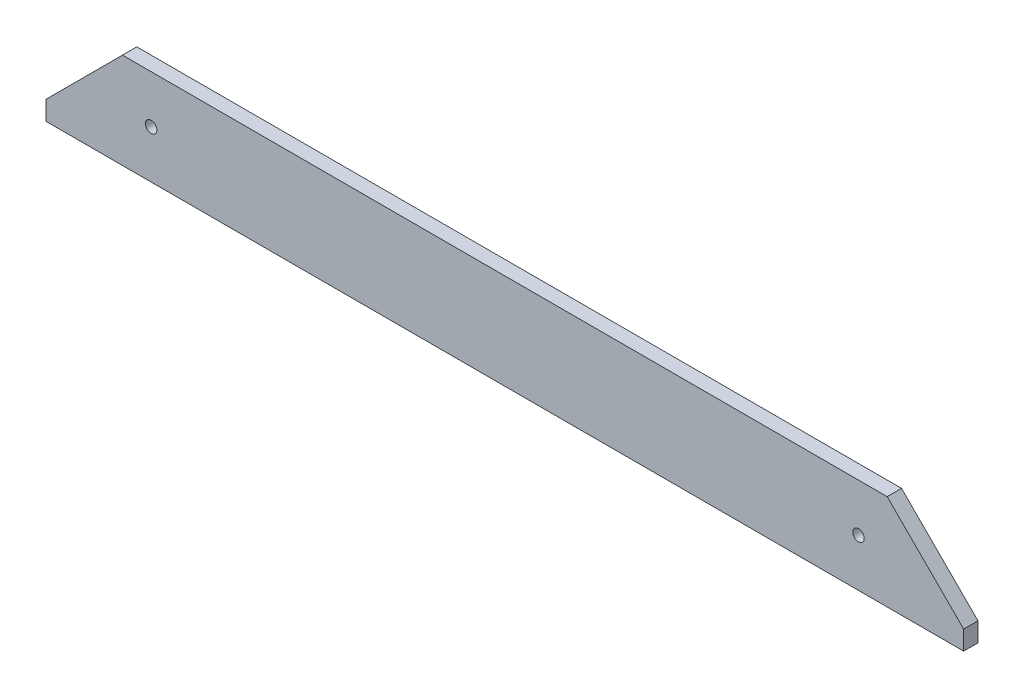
ISO-10303-21;
HEADER;
FILE_DESCRIPTION(('STEP AP214'),'2;1');
FILE_NAME('part.step','',(''),(''),'','','');
FILE_SCHEMA(('AUTOMOTIVE_DESIGN { 1 0 10303 214 1 1 1 1 }'));
ENDSEC;
DATA;
#1=APPLICATION_CONTEXT('core data for automotive mechanical design processes');
#2=APPLICATION_PROTOCOL_DEFINITION('international standard','automotive_design',2000,#1);
#3=PRODUCT_CONTEXT('',#1,'mechanical');
#4=PRODUCT('Part','Part','',(#3));
#5=PRODUCT_RELATED_PRODUCT_CATEGORY('part','',(#4));
#6=PRODUCT_DEFINITION_FORMATION('','',#4);
#7=PRODUCT_DEFINITION_CONTEXT('part definition',#1,'design');
#8=PRODUCT_DEFINITION('design','',#6,#7);
#9=PRODUCT_DEFINITION_SHAPE('','',#8);
#10=(LENGTH_UNIT() NAMED_UNIT(*) SI_UNIT(.MILLI.,.METRE.));
#11=(NAMED_UNIT(*) PLANE_ANGLE_UNIT() SI_UNIT($,.RADIAN.));
#12=(NAMED_UNIT(*) SI_UNIT($,.STERADIAN.) SOLID_ANGLE_UNIT());
#13=UNCERTAINTY_MEASURE_WITH_UNIT(LENGTH_MEASURE(1.E-05),#10,'distance_accuracy_value','');
#14=(GEOMETRIC_REPRESENTATION_CONTEXT(3) GLOBAL_UNCERTAINTY_ASSIGNED_CONTEXT((#13)) GLOBAL_UNIT_ASSIGNED_CONTEXT((#10,
#11,#12)) REPRESENTATION_CONTEXT('',''));
#15=CARTESIAN_POINT('',(0.,0.,0.));
#16=DIRECTION('',(0.,0.,1.));
#17=DIRECTION('',(1.,0.,0.));
#18=AXIS2_PLACEMENT_3D('',#15,#16,#17);
#19=CARTESIAN_POINT('',(-304.8,-31.75,4.7625));
#20=DIRECTION('',(1.,0.,0.));
#21=DIRECTION('',(0.,0.,-1.));
#22=AXIS2_PLACEMENT_3D('',#19,#20,#21);
#23=PLANE('',#22);
#24=DIRECTION('',(0.,-1.,0.));
#25=VECTOR('',#24,1.);
#26=CARTESIAN_POINT('',(-304.8,-31.75,4.7625));
#27=LINE('',#26,#25);
#28=CARTESIAN_POINT('',(-304.8,-19.05,4.7625));
#29=VERTEX_POINT('',#28);
#30=CARTESIAN_POINT('',(-304.8,-31.75,4.7625));
#31=VERTEX_POINT('',#30);
#32=EDGE_CURVE('E142',#29,#31,#27,.T.);
#33=ORIENTED_EDGE('',*,*,#32,.F.);
#34=DIRECTION('',(0.,0.,-1.));
#35=VECTOR('',#34,1.);
#36=CARTESIAN_POINT('',(-304.8,-19.05,4.7625));
#37=LINE('',#36,#35);
#38=CARTESIAN_POINT('',(-304.8,-19.05,-4.7625));
#39=VERTEX_POINT('',#38);
#40=EDGE_CURVE('E95',#29,#39,#37,.T.);
#41=ORIENTED_EDGE('',*,*,#40,.T.);
#42=DIRECTION('',(0.,-1.,0.));
#43=VECTOR('',#42,1.);
#44=CARTESIAN_POINT('',(-304.8,-31.75,-4.7625));
#45=LINE('',#44,#43);
#46=CARTESIAN_POINT('',(-304.8,-31.75,-4.7625));
#47=VERTEX_POINT('',#46);
#48=EDGE_CURVE('E89',#39,#47,#45,.T.);
#49=ORIENTED_EDGE('',*,*,#48,.T.);
#50=DIRECTION('',(0.,0.,-1.));
#51=VECTOR('',#50,1.);
#52=CARTESIAN_POINT('',(-304.8,-31.75,4.7625));
#53=LINE('',#52,#51);
#54=EDGE_CURVE('E93',#31,#47,#53,.T.);
#55=ORIENTED_EDGE('',*,*,#54,.F.);
#56=EDGE_LOOP('',(#33,#41,#49,#55));
#57=FACE_BOUND('',#56,.T.);
#58=ADVANCED_FACE('F37',(#57),#23,.F.);
#59=CARTESIAN_POINT('',(-304.8,-31.75,4.7625));
#60=DIRECTION('',(0.,1.,0.));
#61=DIRECTION('',(0.,0.,1.));
#62=AXIS2_PLACEMENT_3D('',#59,#60,#61);
#63=PLANE('',#62);
#64=DIRECTION('',(1.,0.,0.));
#65=VECTOR('',#64,1.);
#66=CARTESIAN_POINT('',(-304.8,-31.75,-4.7625));
#67=LINE('',#66,#65);
#68=CARTESIAN_POINT('',(304.8,-31.75,-4.7625));
#69=VERTEX_POINT('',#68);
#70=EDGE_CURVE('E96',#47,#69,#67,.T.);
#71=ORIENTED_EDGE('',*,*,#70,.T.);
#72=DIRECTION('',(0.,0.,-1.));
#73=VECTOR('',#72,1.);
#74=CARTESIAN_POINT('',(304.8,-31.75,4.7625));
#75=LINE('',#74,#73);
#76=CARTESIAN_POINT('',(304.8,-31.75,4.7625));
#77=VERTEX_POINT('',#76);
#78=EDGE_CURVE('E111',#77,#69,#75,.T.);
#79=ORIENTED_EDGE('',*,*,#78,.F.);
#80=DIRECTION('',(1.,0.,0.));
#81=VECTOR('',#80,1.);
#82=CARTESIAN_POINT('',(-304.8,-31.75,4.7625));
#83=LINE('',#82,#81);
#84=EDGE_CURVE('E109',#31,#77,#83,.T.);
#85=ORIENTED_EDGE('',*,*,#84,.F.);
#86=ORIENTED_EDGE('',*,*,#54,.T.);
#87=EDGE_LOOP('',(#71,#79,#85,#86));
#88=FACE_BOUND('',#87,.T.);
#89=ADVANCED_FACE('F108',(#88),#63,.F.);
#90=CARTESIAN_POINT('',(304.8,-31.75,4.7625));
#91=DIRECTION('',(-1.,0.,0.));
#92=DIRECTION('',(0.,0.,1.));
#93=AXIS2_PLACEMENT_3D('',#90,#91,#92);
#94=PLANE('',#93);
#95=DIRECTION('',(0.,1.,0.));
#96=VECTOR('',#95,1.);
#97=CARTESIAN_POINT('',(304.8,-31.75,-4.7625));
#98=LINE('',#97,#96);
#99=CARTESIAN_POINT('',(304.8,-19.0500000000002,-4.7625));
#100=VERTEX_POINT('',#99);
#101=EDGE_CURVE('E102',#69,#100,#98,.T.);
#102=ORIENTED_EDGE('',*,*,#101,.T.);
#103=DIRECTION('',(0.,0.,1.));
#104=VECTOR('',#103,1.);
#105=CARTESIAN_POINT('',(304.8,-19.0500000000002,4.7625));
#106=LINE('',#105,#104);
#107=CARTESIAN_POINT('',(304.8,-19.0500000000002,4.7625));
#108=VERTEX_POINT('',#107);
#109=EDGE_CURVE('E121',#100,#108,#106,.T.);
#110=ORIENTED_EDGE('',*,*,#109,.T.);
#111=DIRECTION('',(0.,1.,0.));
#112=VECTOR('',#111,1.);
#113=CARTESIAN_POINT('',(304.8,-31.75,4.7625));
#114=LINE('',#113,#112);
#115=EDGE_CURVE('E132',#77,#108,#114,.T.);
#116=ORIENTED_EDGE('',*,*,#115,.F.);
#117=ORIENTED_EDGE('',*,*,#78,.T.);
#118=EDGE_LOOP('',(#102,#110,#116,#117));
#119=FACE_BOUND('',#118,.T.);
#120=ADVANCED_FACE('F140',(#119),#94,.F.);
#121=CARTESIAN_POINT('',(-304.8,31.75,4.7625));
#122=DIRECTION('',(0.,-1.,0.));
#123=DIRECTION('',(0.,0.,-1.));
#124=AXIS2_PLACEMENT_3D('',#121,#122,#123);
#125=PLANE('',#124);
#126=DIRECTION('',(-1.,0.,0.));
#127=VECTOR('',#126,1.);
#128=CARTESIAN_POINT('',(-304.8,31.75,-4.7625));
#129=LINE('',#128,#127);
#130=CARTESIAN_POINT('',(254.,31.75,-4.7625));
#131=VERTEX_POINT('',#130);
#132=CARTESIAN_POINT('',(-254.,31.75,-4.7625));
#133=VERTEX_POINT('',#132);
#134=EDGE_CURVE('E138',#131,#133,#129,.T.);
#135=ORIENTED_EDGE('',*,*,#134,.T.);
#136=DIRECTION('',(0.,0.,1.));
#137=VECTOR('',#136,1.);
#138=CARTESIAN_POINT('',(-254.,31.75,4.7625));
#139=LINE('',#138,#137);
#140=CARTESIAN_POINT('',(-254.,31.75,4.7625));
#141=VERTEX_POINT('',#140);
#142=EDGE_CURVE('E44',#133,#141,#139,.T.);
#143=ORIENTED_EDGE('',*,*,#142,.T.);
#144=DIRECTION('',(-1.,0.,0.));
#145=VECTOR('',#144,1.);
#146=CARTESIAN_POINT('',(-304.8,31.75,4.7625));
#147=LINE('',#146,#145);
#148=CARTESIAN_POINT('',(254.,31.75,4.7625));
#149=VERTEX_POINT('',#148);
#150=EDGE_CURVE('E116',#149,#141,#147,.T.);
#151=ORIENTED_EDGE('',*,*,#150,.F.);
#152=DIRECTION('',(0.,0.,-1.));
#153=VECTOR('',#152,1.);
#154=CARTESIAN_POINT('',(254.,31.75,4.7625));
#155=LINE('',#154,#153);
#156=EDGE_CURVE('E110',#149,#131,#155,.T.);
#157=ORIENTED_EDGE('',*,*,#156,.T.);
#158=EDGE_LOOP('',(#135,#143,#151,#157));
#159=FACE_BOUND('',#158,.T.);
#160=ADVANCED_FACE('F136',(#159),#125,.F.);
#161=CARTESIAN_POINT('',(-304.8,31.75,4.7625));
#162=DIRECTION('',(0.,0.,-1.));
#163=DIRECTION('',(-1.,0.,0.));
#164=AXIS2_PLACEMENT_3D('',#161,#162,#163);
#165=PLANE('',#164);
#166=CARTESIAN_POINT('',(234.95,0.,4.7625));
#167=DIRECTION('',(0.,0.,1.));
#168=DIRECTION('',(1.,0.,0.));
#169=AXIS2_PLACEMENT_3D('',#166,#167,#168);
#170=CIRCLE('',#169,3.80999999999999);
#171=CARTESIAN_POINT('',(238.76,0.,4.7625));
#172=VERTEX_POINT('',#171);
#173=EDGE_CURVE('E187',#172,#172,#170,.T.);
#174=ORIENTED_EDGE('',*,*,#173,.F.);
#175=EDGE_LOOP('',(#174));
#176=FACE_BOUND('',#175,.T.);
#177=CARTESIAN_POINT('',(-234.95,0.,4.7625));
#178=DIRECTION('',(0.,0.,1.));
#179=DIRECTION('',(1.,0.,0.));
#180=AXIS2_PLACEMENT_3D('',#177,#178,#179);
#181=CIRCLE('',#180,3.80999999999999);
#182=CARTESIAN_POINT('',(-231.14,0.,4.7625));
#183=VERTEX_POINT('',#182);
#184=EDGE_CURVE('E189',#183,#183,#181,.T.);
#185=ORIENTED_EDGE('',*,*,#184,.F.);
#186=EDGE_LOOP('',(#185));
#187=FACE_BOUND('',#186,.T.);
#188=ORIENTED_EDGE('',*,*,#150,.T.);
#189=DIRECTION('',(0.707106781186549,0.707106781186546,0.));
#190=VECTOR('',#189,1.);
#191=CARTESIAN_POINT('',(-304.8,-19.05,4.7625));
#192=LINE('',#191,#190);
#193=EDGE_CURVE('E11',#141,#29,#192,.F.);
#194=ORIENTED_EDGE('',*,*,#193,.T.);
#195=ORIENTED_EDGE('',*,*,#32,.T.);
#196=ORIENTED_EDGE('',*,*,#84,.T.);
#197=ORIENTED_EDGE('',*,*,#115,.T.);
#198=DIRECTION('',(0.707106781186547,-0.707106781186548,0.));
#199=VECTOR('',#198,1.);
#200=CARTESIAN_POINT('',(254.,31.75,4.7625));
#201=LINE('',#200,#199);
#202=EDGE_CURVE('E123',#108,#149,#201,.F.);
#203=ORIENTED_EDGE('',*,*,#202,.T.);
#204=EDGE_LOOP('',(#188,#194,#195,#196,#197,#203));
#205=FACE_BOUND('',#204,.T.);
#206=ADVANCED_FACE('F129',(#176,#187,#205),#165,.F.);
#207=CARTESIAN_POINT('',(-304.8,31.75,-4.7625));
#208=DIRECTION('',(0.,0.,-1.));
#209=DIRECTION('',(-1.,0.,0.));
#210=AXIS2_PLACEMENT_3D('',#207,#208,#209);
#211=PLANE('',#210);
#212=CARTESIAN_POINT('',(234.95,0.,-4.7625));
#213=DIRECTION('',(0.,0.,1.));
#214=DIRECTION('',(1.,0.,0.));
#215=AXIS2_PLACEMENT_3D('',#212,#213,#214);
#216=CIRCLE('',#215,3.80999999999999);
#217=CARTESIAN_POINT('',(238.76,0.,-4.7625));
#218=VERTEX_POINT('',#217);
#219=EDGE_CURVE('E184',#218,#218,#216,.T.);
#220=ORIENTED_EDGE('',*,*,#219,.T.);
#221=EDGE_LOOP('',(#220));
#222=FACE_BOUND('',#221,.T.);
#223=CARTESIAN_POINT('',(-234.95,0.,-4.7625));
#224=DIRECTION('',(0.,0.,1.));
#225=DIRECTION('',(1.,0.,0.));
#226=AXIS2_PLACEMENT_3D('',#223,#224,#225);
#227=CIRCLE('',#226,3.80999999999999);
#228=CARTESIAN_POINT('',(-231.14,0.,-4.7625));
#229=VERTEX_POINT('',#228);
#230=EDGE_CURVE('E97',#229,#229,#227,.T.);
#231=ORIENTED_EDGE('',*,*,#230,.T.);
#232=EDGE_LOOP('',(#231));
#233=FACE_BOUND('',#232,.T.);
#234=ORIENTED_EDGE('',*,*,#48,.F.);
#235=DIRECTION('',(-0.707106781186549,-0.707106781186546,0.));
#236=VECTOR('',#235,1.);
#237=CARTESIAN_POINT('',(-279.4,6.34999999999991,-4.7625));
#238=LINE('',#237,#236);
#239=EDGE_CURVE('E58',#39,#133,#238,.F.);
#240=ORIENTED_EDGE('',*,*,#239,.T.);
#241=ORIENTED_EDGE('',*,*,#134,.F.);
#242=DIRECTION('',(-0.707106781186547,0.707106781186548,0.));
#243=VECTOR('',#242,1.);
#244=CARTESIAN_POINT('',(-25.3999999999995,311.15,-4.7625));
#245=LINE('',#244,#243);
#246=EDGE_CURVE('E114',#131,#100,#245,.F.);
#247=ORIENTED_EDGE('',*,*,#246,.T.);
#248=ORIENTED_EDGE('',*,*,#101,.F.);
#249=ORIENTED_EDGE('',*,*,#70,.F.);
#250=EDGE_LOOP('',(#234,#240,#241,#247,#248,#249));
#251=FACE_BOUND('',#250,.T.);
#252=ADVANCED_FACE('F100',(#222,#233,#251),#211,.T.);
#253=CARTESIAN_POINT('',(-234.95,0.,-4.7625));
#254=DIRECTION('',(0.,0.,1.));
#255=DIRECTION('',(1.,0.,0.));
#256=AXIS2_PLACEMENT_3D('',#253,#254,#255);
#257=CYLINDRICAL_SURFACE('',#256,3.80999999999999);
#258=CARTESIAN_POINT('',(-231.14,0.,-4.7625));
#259=CARTESIAN_POINT('',(-231.14,0.,-4.66328125));
#260=CARTESIAN_POINT('',(-231.14,0.,-4.5640625));
#261=CARTESIAN_POINT('',(-231.14,0.,-4.365625));
#262=CARTESIAN_POINT('',(-231.14,0.,-4.26640625));
#263=CARTESIAN_POINT('',(-231.14,0.,-4.06796875));
#264=CARTESIAN_POINT('',(-231.14,0.,-3.96875));
#265=CARTESIAN_POINT('',(-231.14,0.,-3.7703125));
#266=CARTESIAN_POINT('',(-231.14,0.,-3.67109375));
#267=CARTESIAN_POINT('',(-231.14,0.,-3.47265625));
#268=CARTESIAN_POINT('',(-231.14,0.,-3.3734375));
#269=CARTESIAN_POINT('',(-231.14,0.,-3.175));
#270=CARTESIAN_POINT('',(-231.14,0.,-3.07578125));
#271=CARTESIAN_POINT('',(-231.14,0.,-2.87734375));
#272=CARTESIAN_POINT('',(-231.14,0.,-2.778125));
#273=CARTESIAN_POINT('',(-231.14,0.,-2.5796875));
#274=CARTESIAN_POINT('',(-231.14,0.,-2.48046875));
#275=CARTESIAN_POINT('',(-231.14,0.,-2.28203125));
#276=CARTESIAN_POINT('',(-231.14,0.,-2.1828125));
#277=CARTESIAN_POINT('',(-231.14,0.,-1.984375));
#278=CARTESIAN_POINT('',(-231.14,0.,-1.88515625));
#279=CARTESIAN_POINT('',(-231.14,0.,-1.68671875));
#280=CARTESIAN_POINT('',(-231.14,0.,-1.5875));
#281=CARTESIAN_POINT('',(-231.14,0.,-1.3890625));
#282=CARTESIAN_POINT('',(-231.14,0.,-1.28984375));
#283=CARTESIAN_POINT('',(-231.14,0.,-1.09140625));
#284=CARTESIAN_POINT('',(-231.14,0.,-0.9921875));
#285=CARTESIAN_POINT('',(-231.14,0.,-0.793750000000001));
#286=CARTESIAN_POINT('',(-231.14,0.,-0.694531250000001));
#287=CARTESIAN_POINT('',(-231.14,0.,-0.496093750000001));
#288=CARTESIAN_POINT('',(-231.14,0.,-0.396875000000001));
#289=CARTESIAN_POINT('',(-231.14,0.,-0.198437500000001));
#290=CARTESIAN_POINT('',(-231.14,0.,-0.0992187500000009));
#291=CARTESIAN_POINT('',(-231.14,0.,0.0992187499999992));
#292=CARTESIAN_POINT('',(-231.14,0.,0.198437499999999));
#293=CARTESIAN_POINT('',(-231.14,0.,0.396874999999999));
#294=CARTESIAN_POINT('',(-231.14,0.,0.496093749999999));
#295=CARTESIAN_POINT('',(-231.14,0.,0.694531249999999));
#296=CARTESIAN_POINT('',(-231.14,0.,0.79375));
#297=CARTESIAN_POINT('',(-231.14,0.,0.9921875));
#298=CARTESIAN_POINT('',(-231.14,0.,1.09140625));
#299=CARTESIAN_POINT('',(-231.14,0.,1.28984375));
#300=CARTESIAN_POINT('',(-231.14,0.,1.3890625));
#301=CARTESIAN_POINT('',(-231.14,0.,1.5875));
#302=CARTESIAN_POINT('',(-231.14,0.,1.68671875));
#303=CARTESIAN_POINT('',(-231.14,0.,1.88515625));
#304=CARTESIAN_POINT('',(-231.14,0.,1.984375));
#305=CARTESIAN_POINT('',(-231.14,0.,2.1828125));
#306=CARTESIAN_POINT('',(-231.14,0.,2.28203125));
#307=CARTESIAN_POINT('',(-231.14,0.,2.48046875));
#308=CARTESIAN_POINT('',(-231.14,0.,2.5796875));
#309=CARTESIAN_POINT('',(-231.14,0.,2.778125));
#310=CARTESIAN_POINT('',(-231.14,0.,2.87734375));
#311=CARTESIAN_POINT('',(-231.14,0.,3.07578125));
#312=CARTESIAN_POINT('',(-231.14,0.,3.175));
#313=CARTESIAN_POINT('',(-231.14,0.,3.3734375));
#314=CARTESIAN_POINT('',(-231.14,0.,3.47265625));
#315=CARTESIAN_POINT('',(-231.14,0.,3.67109375));
#316=CARTESIAN_POINT('',(-231.14,0.,3.7703125));
#317=CARTESIAN_POINT('',(-231.14,0.,3.96875));
#318=CARTESIAN_POINT('',(-231.14,0.,4.06796875));
#319=CARTESIAN_POINT('',(-231.14,0.,4.26640625));
#320=CARTESIAN_POINT('',(-231.14,0.,4.365625));
#321=CARTESIAN_POINT('',(-231.14,0.,4.5640625));
#322=CARTESIAN_POINT('',(-231.14,0.,4.66328125));
#323=CARTESIAN_POINT('',(-231.14,0.,4.7625));
#324=B_SPLINE_CURVE_WITH_KNOTS('',3,(#258,#259,#260,#261,#262,#263,#264,#265,#266,#267,#268,
#269,#270,#271,#272,#273,#274,#275,#276,#277,#278,#279,#280,#281,#282,#283,#284,#285,#286,#287,
#288,#289,#290,#291,#292,#293,#294,#295,#296,#297,#298,#299,#300,#301,#302,#303,#304,#305,#306,
#307,#308,#309,#310,#311,#312,#313,#314,#315,#316,#317,#318,#319,#320,#321,#322,#323),
.UNSPECIFIED.,.F.,.F.,(4,2,2,2,2,2,2,2,2,2,2,2,2,2,2,2,2,2,2,2,2,2,2,2,2,2,2,2,2,2,2,2,4),(0.,
0.29765625,0.5953125,0.892968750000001,1.190625,1.48828125,1.7859375,2.08359375,2.38125,
2.67890625,2.9765625,3.27421875,3.571875,3.86953125,4.1671875,4.46484375,4.7625,5.06015625,
5.3578125,5.65546875,5.953125,6.25078125,6.5484375,6.84609375,7.14375,7.44140625,7.7390625,
8.03671875,8.334375,8.63203125,8.9296875,9.22734375,9.525),.UNSPECIFIED.);
#325=EDGE_CURVE('BSEAM172',#229,#183,#324,.T.);
#326=ORIENTED_EDGE('',*,*,#230,.F.);
#327=ORIENTED_EDGE('',*,*,#184,.T.);
#328=ORIENTED_EDGE('',*,*,#325,.T.);
#329=ORIENTED_EDGE('',*,*,#325,.F.);
#330=EDGE_LOOP('',(#326,#328,#327,#329));
#331=FACE_BOUND('',#330,.T.);
#332=ADVANCED_FACE('F172',(#331),#257,.F.);
#333=CARTESIAN_POINT('',(234.95,0.,-4.7625));
#334=DIRECTION('',(0.,0.,1.));
#335=DIRECTION('',(1.,0.,0.));
#336=AXIS2_PLACEMENT_3D('',#333,#334,#335);
#337=CYLINDRICAL_SURFACE('',#336,3.80999999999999);
#338=CARTESIAN_POINT('',(238.76,0.,-4.7625));
#339=CARTESIAN_POINT('',(238.76,0.,-4.66328125));
#340=CARTESIAN_POINT('',(238.76,0.,-4.5640625));
#341=CARTESIAN_POINT('',(238.76,0.,-4.365625));
#342=CARTESIAN_POINT('',(238.76,0.,-4.26640625));
#343=CARTESIAN_POINT('',(238.76,0.,-4.06796875));
#344=CARTESIAN_POINT('',(238.76,0.,-3.96875));
#345=CARTESIAN_POINT('',(238.76,0.,-3.7703125));
#346=CARTESIAN_POINT('',(238.76,0.,-3.67109375));
#347=CARTESIAN_POINT('',(238.76,0.,-3.47265625));
#348=CARTESIAN_POINT('',(238.76,0.,-3.3734375));
#349=CARTESIAN_POINT('',(238.76,0.,-3.175));
#350=CARTESIAN_POINT('',(238.76,0.,-3.07578125));
#351=CARTESIAN_POINT('',(238.76,0.,-2.87734375));
#352=CARTESIAN_POINT('',(238.76,0.,-2.778125));
#353=CARTESIAN_POINT('',(238.76,0.,-2.5796875));
#354=CARTESIAN_POINT('',(238.76,0.,-2.48046875));
#355=CARTESIAN_POINT('',(238.76,0.,-2.28203125));
#356=CARTESIAN_POINT('',(238.76,0.,-2.1828125));
#357=CARTESIAN_POINT('',(238.76,0.,-1.984375));
#358=CARTESIAN_POINT('',(238.76,0.,-1.88515625));
#359=CARTESIAN_POINT('',(238.76,0.,-1.68671875));
#360=CARTESIAN_POINT('',(238.76,0.,-1.5875));
#361=CARTESIAN_POINT('',(238.76,0.,-1.3890625));
#362=CARTESIAN_POINT('',(238.76,0.,-1.28984375));
#363=CARTESIAN_POINT('',(238.76,0.,-1.09140625));
#364=CARTESIAN_POINT('',(238.76,0.,-0.9921875));
#365=CARTESIAN_POINT('',(238.76,0.,-0.793750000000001));
#366=CARTESIAN_POINT('',(238.76,0.,-0.694531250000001));
#367=CARTESIAN_POINT('',(238.76,0.,-0.496093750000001));
#368=CARTESIAN_POINT('',(238.76,0.,-0.396875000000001));
#369=CARTESIAN_POINT('',(238.76,0.,-0.198437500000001));
#370=CARTESIAN_POINT('',(238.76,0.,-0.0992187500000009));
#371=CARTESIAN_POINT('',(238.76,0.,0.0992187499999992));
#372=CARTESIAN_POINT('',(238.76,0.,0.198437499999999));
#373=CARTESIAN_POINT('',(238.76,0.,0.396874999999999));
#374=CARTESIAN_POINT('',(238.76,0.,0.496093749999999));
#375=CARTESIAN_POINT('',(238.76,0.,0.694531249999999));
#376=CARTESIAN_POINT('',(238.76,0.,0.79375));
#377=CARTESIAN_POINT('',(238.76,0.,0.9921875));
#378=CARTESIAN_POINT('',(238.76,0.,1.09140625));
#379=CARTESIAN_POINT('',(238.76,0.,1.28984375));
#380=CARTESIAN_POINT('',(238.76,0.,1.3890625));
#381=CARTESIAN_POINT('',(238.76,0.,1.5875));
#382=CARTESIAN_POINT('',(238.76,0.,1.68671875));
#383=CARTESIAN_POINT('',(238.76,0.,1.88515625));
#384=CARTESIAN_POINT('',(238.76,0.,1.984375));
#385=CARTESIAN_POINT('',(238.76,0.,2.1828125));
#386=CARTESIAN_POINT('',(238.76,0.,2.28203125));
#387=CARTESIAN_POINT('',(238.76,0.,2.48046875));
#388=CARTESIAN_POINT('',(238.76,0.,2.5796875));
#389=CARTESIAN_POINT('',(238.76,0.,2.778125));
#390=CARTESIAN_POINT('',(238.76,0.,2.87734375));
#391=CARTESIAN_POINT('',(238.76,0.,3.07578125));
#392=CARTESIAN_POINT('',(238.76,0.,3.175));
#393=CARTESIAN_POINT('',(238.76,0.,3.3734375));
#394=CARTESIAN_POINT('',(238.76,0.,3.47265625));
#395=CARTESIAN_POINT('',(238.76,0.,3.67109375));
#396=CARTESIAN_POINT('',(238.76,0.,3.7703125));
#397=CARTESIAN_POINT('',(238.76,0.,3.96875));
#398=CARTESIAN_POINT('',(238.76,0.,4.06796875));
#399=CARTESIAN_POINT('',(238.76,0.,4.26640625));
#400=CARTESIAN_POINT('',(238.76,0.,4.365625));
#401=CARTESIAN_POINT('',(238.76,0.,4.5640625));
#402=CARTESIAN_POINT('',(238.76,0.,4.66328125));
#403=CARTESIAN_POINT('',(238.76,0.,4.7625));
#404=B_SPLINE_CURVE_WITH_KNOTS('',3,(#338,#339,#340,#341,#342,#343,#344,#345,#346,#347,#348,
#349,#350,#351,#352,#353,#354,#355,#356,#357,#358,#359,#360,#361,#362,#363,#364,#365,#366,#367,
#368,#369,#370,#371,#372,#373,#374,#375,#376,#377,#378,#379,#380,#381,#382,#383,#384,#385,#386,
#387,#388,#389,#390,#391,#392,#393,#394,#395,#396,#397,#398,#399,#400,#401,#402,#403),
.UNSPECIFIED.,.F.,.F.,(4,2,2,2,2,2,2,2,2,2,2,2,2,2,2,2,2,2,2,2,2,2,2,2,2,2,2,2,2,2,2,2,4),(0.,
0.29765625,0.5953125,0.892968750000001,1.190625,1.48828125,1.7859375,2.08359375,2.38125,
2.67890625,2.9765625,3.27421875,3.571875,3.86953125,4.1671875,4.46484375,4.7625,5.06015625,
5.3578125,5.65546875,5.953125,6.25078125,6.5484375,6.84609375,7.14375,7.44140625,7.7390625,
8.03671875,8.334375,8.63203125,8.9296875,9.22734375,9.525),.UNSPECIFIED.);
#405=EDGE_CURVE('BSEAM154',#218,#172,#404,.T.);
#406=ORIENTED_EDGE('',*,*,#219,.F.);
#407=ORIENTED_EDGE('',*,*,#173,.T.);
#408=ORIENTED_EDGE('',*,*,#405,.T.);
#409=ORIENTED_EDGE('',*,*,#405,.F.);
#410=EDGE_LOOP('',(#406,#408,#407,#409));
#411=FACE_BOUND('',#410,.T.);
#412=ADVANCED_FACE('F154',(#411),#337,.F.);
#413=CARTESIAN_POINT('',(254.,31.75,4.7625));
#414=DIRECTION('',(-0.707106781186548,-0.707106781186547,0.));
#415=DIRECTION('',(0.707106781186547,-0.707106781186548,0.));
#416=AXIS2_PLACEMENT_3D('',#413,#414,#415);
#417=PLANE('',#416);
#418=ORIENTED_EDGE('',*,*,#202,.F.);
#419=ORIENTED_EDGE('',*,*,#109,.F.);
#420=ORIENTED_EDGE('',*,*,#246,.F.);
#421=ORIENTED_EDGE('',*,*,#156,.F.);
#422=EDGE_LOOP('',(#418,#419,#420,#421));
#423=FACE_BOUND('',#422,.T.);
#424=ADVANCED_FACE('F137',(#423),#417,.F.);
#425=CARTESIAN_POINT('',(-304.8,-19.05,4.7625));
#426=DIRECTION('',(0.707106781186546,-0.707106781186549,0.));
#427=DIRECTION('',(0.707106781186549,0.707106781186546,0.));
#428=AXIS2_PLACEMENT_3D('',#425,#426,#427);
#429=PLANE('',#428);
#430=ORIENTED_EDGE('',*,*,#193,.F.);
#431=ORIENTED_EDGE('',*,*,#142,.F.);
#432=ORIENTED_EDGE('',*,*,#239,.F.);
#433=ORIENTED_EDGE('',*,*,#40,.F.);
#434=EDGE_LOOP('',(#430,#431,#432,#433));
#435=FACE_BOUND('',#434,.T.);
#436=ADVANCED_FACE('F148',(#435),#429,.F.);
#437=CLOSED_SHELL('',(#58,#89,#120,#160,#206,#252,#332,#412,#424,#436));
#438=MANIFOLD_SOLID_BREP('B2',#437);
#439=ADVANCED_BREP_SHAPE_REPRESENTATION('',(#18,#438),#14);
#440=SHAPE_DEFINITION_REPRESENTATION(#9,#439);
ENDSEC;
END-ISO-10303-21;
